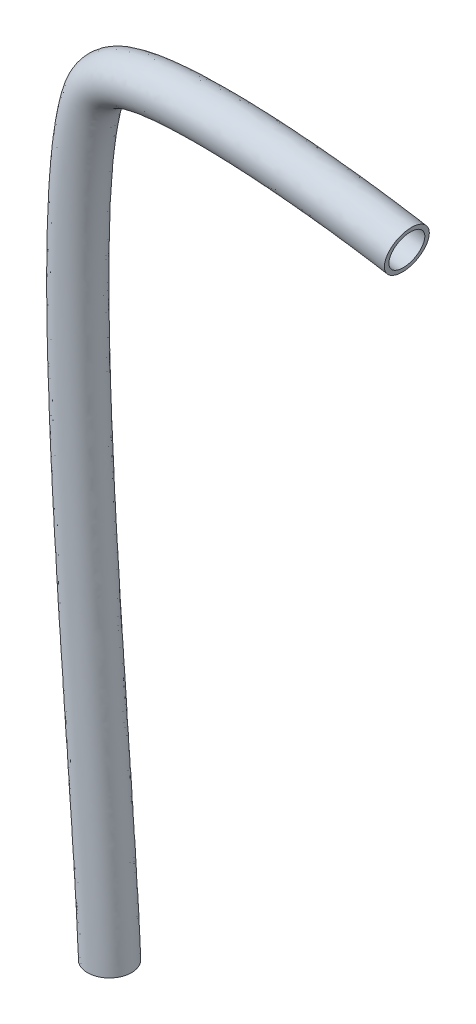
ISO-10303-21;
HEADER;
FILE_DESCRIPTION(('STEP AP214'),'2;1');
FILE_NAME('part.step','',(''),(''),'','','');
FILE_SCHEMA(('AUTOMOTIVE_DESIGN { 1 0 10303 214 1 1 1 1 }'));
ENDSEC;
DATA;
#1=APPLICATION_CONTEXT('core data for automotive mechanical design processes');
#2=APPLICATION_PROTOCOL_DEFINITION('international standard','automotive_design',2000,#1);
#3=PRODUCT_CONTEXT('',#1,'mechanical');
#4=PRODUCT('Part','Part','',(#3));
#5=PRODUCT_RELATED_PRODUCT_CATEGORY('part','',(#4));
#6=PRODUCT_DEFINITION_FORMATION('','',#4);
#7=PRODUCT_DEFINITION_CONTEXT('part definition',#1,'design');
#8=PRODUCT_DEFINITION('design','',#6,#7);
#9=PRODUCT_DEFINITION_SHAPE('','',#8);
#10=(LENGTH_UNIT() NAMED_UNIT(*) SI_UNIT(.MILLI.,.METRE.));
#11=(NAMED_UNIT(*) PLANE_ANGLE_UNIT() SI_UNIT($,.RADIAN.));
#12=(NAMED_UNIT(*) SI_UNIT($,.STERADIAN.) SOLID_ANGLE_UNIT());
#13=UNCERTAINTY_MEASURE_WITH_UNIT(LENGTH_MEASURE(1.E-05),#10,'distance_accuracy_value','');
#14=(GEOMETRIC_REPRESENTATION_CONTEXT(3) GLOBAL_UNCERTAINTY_ASSIGNED_CONTEXT((#13)) GLOBAL_UNIT_ASSIGNED_CONTEXT((#10,
#11,#12)) REPRESENTATION_CONTEXT('',''));
#15=CARTESIAN_POINT('',(0.,0.,0.));
#16=DIRECTION('',(0.,0.,1.));
#17=DIRECTION('',(1.,0.,0.));
#18=AXIS2_PLACEMENT_3D('',#15,#16,#17);
#19=CARTESIAN_POINT('',(0.,0.,5.));
#20=CARTESIAN_POINT('',(-0.169825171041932,4.63118092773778,5.));
#21=CARTESIAN_POINT('',(-0.485152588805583,10.1818612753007,5.));
#22=CARTESIAN_POINT('',(-1.29961480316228,22.6430210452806,5.));
#23=CARTESIAN_POINT('',(-1.79874959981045,29.5535004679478,5.));
#24=CARTESIAN_POINT('',(-3.41106938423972,51.6058376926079,5.));
#25=CARTESIAN_POINT('',(-4.63916976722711,68.0685944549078,5.));
#26=CARTESIAN_POINT('',(-6.54423466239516,100.682907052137,5.));
#27=CARTESIAN_POINT('',(-7.22119917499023,116.834462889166,5.));
#28=CARTESIAN_POINT('',(-7.18011134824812,137.953197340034,5.));
#29=CARTESIAN_POINT('',(-6.99032630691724,144.474675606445,5.));
#30=CARTESIAN_POINT('',(-6.15138091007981,156.002232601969,5.));
#31=CARTESIAN_POINT('',(-5.50222055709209,161.008311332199,5.));
#32=CARTESIAN_POINT('',(-4.29490951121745,166.198789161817,5.));
#33=CARTESIAN_POINT('',(-3.99542919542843,167.29382865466,5.));
#34=CARTESIAN_POINT('',(-3.24426197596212,169.311814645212,5.));
#35=CARTESIAN_POINT('',(-2.79257508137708,170.234761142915,5.));
#36=CARTESIAN_POINT('',(-1.63401981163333,171.909786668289,5.));
#37=CARTESIAN_POINT('',(-0.9271514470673,172.661865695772,5.));
#38=CARTESIAN_POINT('',(0.844741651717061,173.996381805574,5.));
#39=CARTESIAN_POINT('',(1.90976637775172,174.578818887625,5.));
#40=CARTESIAN_POINT('',(4.64036989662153,175.628892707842,5.));
#41=CARTESIAN_POINT('',(6.35824266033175,176.077430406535,5.));
#42=CARTESIAN_POINT('',(10.264142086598,176.786929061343,5.));
#43=CARTESIAN_POINT('',(12.4521687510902,177.047890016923,5.));
#44=CARTESIAN_POINT('',(19.5781316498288,177.577964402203,5.));
#45=CARTESIAN_POINT('',(25.0779507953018,177.594269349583,5.));
#46=CARTESIAN_POINT('',(42.6781563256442,176.860403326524,5.));
#47=CARTESIAN_POINT('',(55.8792908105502,175.32745149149,5.));
#48=CARTESIAN_POINT('',(67.4900000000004,173.36,5.));
#49=CARTESIAN_POINT('',(10.,0.,5.));
#50=CARTESIAN_POINT('',(9.83017482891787,4.79188023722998,5.));
#51=CARTESIAN_POINT('',(9.51220081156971,10.4174084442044,5.));
#52=CARTESIAN_POINT('',(8.69484491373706,22.9796698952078,5.));
#53=CARTESIAN_POINT('',(8.19485211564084,29.911208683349,5.));
#54=CARTESIAN_POINT('',(6.58193139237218,51.9800797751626,5.));
#55=CARTESIAN_POINT('',(5.35612263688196,68.3940440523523,5.));
#56=CARTESIAN_POINT('',(3.45576764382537,100.791265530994,5.));
#57=CARTESIAN_POINT('',(2.78429637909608,116.783748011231,5.));
#58=CARTESIAN_POINT('',(2.80596809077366,137.399712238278,5.));
#59=CARTESIAN_POINT('',(2.98574635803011,143.709580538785,5.));
#60=CARTESIAN_POINT('',(3.7531942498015,154.585621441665,5.));
#61=CARTESIAN_POINT('',(4.36127690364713,159.171921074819,5.));
#62=CARTESIAN_POINT('',(5.29270608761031,163.34658715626,5.));
#63=CARTESIAN_POINT('',(5.48253113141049,164.043899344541,5.));
#64=CARTESIAN_POINT('',(5.75307323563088,164.902536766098,5.));
#65=CARTESIAN_POINT('',(5.81952905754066,165.053836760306,5.));
#66=CARTESIAN_POINT('',(5.77470811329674,165.118537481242,5.));
#67=CARTESIAN_POINT('',(5.65750115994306,165.062192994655,5.));
#68=CARTESIAN_POINT('',(5.69883921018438,165.190110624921,5.));
#69=CARTESIAN_POINT('',(5.88764600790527,165.371376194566,5.));
#70=CARTESIAN_POINT('',(7.07335806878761,165.89147518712,5.));
#71=CARTESIAN_POINT('',(8.23015993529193,166.243846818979,5.));
#72=CARTESIAN_POINT('',(11.2431840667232,166.824754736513,5.));
#73=CARTESIAN_POINT('',(13.1019470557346,167.065259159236,5.));
#74=CARTESIAN_POINT('',(19.4061916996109,167.564425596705,5.));
#75=CARTESIAN_POINT('',(24.5732737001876,167.603126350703,5.));
#76=CARTESIAN_POINT('',(41.3401374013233,166.934666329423,5.));
#77=CARTESIAN_POINT('',(54.2331647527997,165.456044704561,5.));
#78=CARTESIAN_POINT('',(65.4591212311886,163.568394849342,5.));
#79=CARTESIAN_POINT('',(10.,0.,-5.));
#80=CARTESIAN_POINT('',(9.83017482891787,4.79188023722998,-5.));
#81=CARTESIAN_POINT('',(9.51220081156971,10.4174084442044,-5.));
#82=CARTESIAN_POINT('',(8.69484491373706,22.9796698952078,-5.));
#83=CARTESIAN_POINT('',(8.19485211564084,29.911208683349,-5.));
#84=CARTESIAN_POINT('',(6.58193139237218,51.9800797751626,-5.));
#85=CARTESIAN_POINT('',(5.35612263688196,68.3940440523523,-5.));
#86=CARTESIAN_POINT('',(3.45576764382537,100.791265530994,-5.));
#87=CARTESIAN_POINT('',(2.78429637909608,116.783748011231,-5.));
#88=CARTESIAN_POINT('',(2.80596809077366,137.399712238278,-5.));
#89=CARTESIAN_POINT('',(2.98574635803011,143.709580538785,-5.));
#90=CARTESIAN_POINT('',(3.7531942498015,154.585621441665,-5.));
#91=CARTESIAN_POINT('',(4.36127690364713,159.171921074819,-5.));
#92=CARTESIAN_POINT('',(5.2927060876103,163.34658715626,-5.));
#93=CARTESIAN_POINT('',(5.48253113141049,164.043899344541,-5.));
#94=CARTESIAN_POINT('',(5.75307323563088,164.902536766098,-5.));
#95=CARTESIAN_POINT('',(5.81952905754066,165.053836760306,-5.));
#96=CARTESIAN_POINT('',(5.77470811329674,165.118537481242,-5.));
#97=CARTESIAN_POINT('',(5.65750115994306,165.062192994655,-5.));
#98=CARTESIAN_POINT('',(5.69883921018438,165.190110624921,-5.));
#99=CARTESIAN_POINT('',(5.88764600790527,165.371376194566,-5.));
#100=CARTESIAN_POINT('',(7.07335806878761,165.89147518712,-5.));
#101=CARTESIAN_POINT('',(8.23015993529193,166.243846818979,-5.));
#102=CARTESIAN_POINT('',(11.2431840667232,166.824754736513,-5.));
#103=CARTESIAN_POINT('',(13.1019470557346,167.065259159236,-5.));
#104=CARTESIAN_POINT('',(19.4061916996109,167.564425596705,-5.));
#105=CARTESIAN_POINT('',(24.5732737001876,167.603126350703,-5.));
#106=CARTESIAN_POINT('',(41.3401374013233,166.934666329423,-5.));
#107=CARTESIAN_POINT('',(54.2331647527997,165.456044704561,-5.));
#108=CARTESIAN_POINT('',(65.4591212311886,163.568394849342,-5.));
#109=CARTESIAN_POINT('',(0.,0.,-5.));
#110=CARTESIAN_POINT('',(-0.169825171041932,4.63118092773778,-5.));
#111=CARTESIAN_POINT('',(-0.485152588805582,10.1818612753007,-5.));
#112=CARTESIAN_POINT('',(-1.29961480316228,22.6430210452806,-5.));
#113=CARTESIAN_POINT('',(-1.79874959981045,29.5535004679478,-5.));
#114=CARTESIAN_POINT('',(-3.41106938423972,51.6058376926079,-5.));
#115=CARTESIAN_POINT('',(-4.63916976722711,68.0685944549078,-5.));
#116=CARTESIAN_POINT('',(-6.54423466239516,100.682907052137,-5.));
#117=CARTESIAN_POINT('',(-7.22119917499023,116.834462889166,-5.));
#118=CARTESIAN_POINT('',(-7.18011134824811,137.953197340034,-5.));
#119=CARTESIAN_POINT('',(-6.99032630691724,144.474675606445,-5.));
#120=CARTESIAN_POINT('',(-6.15138091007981,156.002232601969,-5.));
#121=CARTESIAN_POINT('',(-5.50222055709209,161.008311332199,-5.));
#122=CARTESIAN_POINT('',(-4.29490951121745,166.198789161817,-5.));
#123=CARTESIAN_POINT('',(-3.99542919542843,167.29382865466,-5.));
#124=CARTESIAN_POINT('',(-3.24426197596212,169.311814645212,-5.));
#125=CARTESIAN_POINT('',(-2.79257508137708,170.234761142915,-5.));
#126=CARTESIAN_POINT('',(-1.63401981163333,171.909786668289,-5.));
#127=CARTESIAN_POINT('',(-0.9271514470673,172.661865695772,-5.));
#128=CARTESIAN_POINT('',(0.844741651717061,173.996381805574,-5.));
#129=CARTESIAN_POINT('',(1.90976637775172,174.578818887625,-5.));
#130=CARTESIAN_POINT('',(4.64036989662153,175.628892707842,-5.));
#131=CARTESIAN_POINT('',(6.35824266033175,176.077430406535,-5.));
#132=CARTESIAN_POINT('',(10.264142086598,176.786929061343,-5.));
#133=CARTESIAN_POINT('',(12.4521687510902,177.047890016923,-5.));
#134=CARTESIAN_POINT('',(19.5781316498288,177.577964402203,-5.));
#135=CARTESIAN_POINT('',(25.0779507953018,177.594269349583,-5.));
#136=CARTESIAN_POINT('',(42.6781563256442,176.860403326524,-5.));
#137=CARTESIAN_POINT('',(55.8792908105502,175.32745149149,-5.));
#138=CARTESIAN_POINT('',(67.4900000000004,173.36,-5.));
#139=CARTESIAN_POINT('',(-10.,0.,-5.));
#140=CARTESIAN_POINT('',(-10.1698251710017,4.47048161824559,-5.));
#141=CARTESIAN_POINT('',(-10.4825059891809,9.94631410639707,-5.));
#142=CARTESIAN_POINT('',(-11.2940745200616,22.3063721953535,-5.));
#143=CARTESIAN_POINT('',(-11.7923513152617,29.1957922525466,-5.));
#144=CARTESIAN_POINT('',(-13.4040701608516,51.2315956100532,-5.));
#145=CARTESIAN_POINT('',(-14.6344621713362,67.7431448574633,-5.));
#146=CARTESIAN_POINT('',(-16.5442369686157,100.574548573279,-5.));
#147=CARTESIAN_POINT('',(-17.2266947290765,116.885177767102,-5.));
#148=CARTESIAN_POINT('',(-17.1661907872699,138.506682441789,-5.));
#149=CARTESIAN_POINT('',(-16.9663989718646,145.239770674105,-5.));
#150=CARTESIAN_POINT('',(-16.0559560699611,157.418843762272,-5.));
#151=CARTESIAN_POINT('',(-15.3657180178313,162.844701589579,-5.));
#152=CARTESIAN_POINT('',(-13.8825251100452,169.050991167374,-5.));
#153=CARTESIAN_POINT('',(-13.4733895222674,170.543757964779,-5.));
#154=CARTESIAN_POINT('',(-12.2415971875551,173.721092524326,-5.));
#155=CARTESIAN_POINT('',(-11.4046792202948,175.415685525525,-5.));
#156=CARTESIAN_POINT('',(-9.0427477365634,178.701035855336,-5.));
#157=CARTESIAN_POINT('',(-7.51180405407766,180.261538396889,-5.));
#158=CARTESIAN_POINT('',(-4.00935590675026,182.802652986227,-5.));
#159=CARTESIAN_POINT('',(-2.06811325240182,183.786261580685,-5.));
#160=CARTESIAN_POINT('',(2.20738172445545,185.366310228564,-5.));
#161=CARTESIAN_POINT('',(4.48632538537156,185.911013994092,-5.));
#162=CARTESIAN_POINT('',(9.2851001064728,186.749103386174,-5.));
#163=CARTESIAN_POINT('',(11.8023904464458,187.030520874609,-5.));
#164=CARTESIAN_POINT('',(19.7500716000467,187.591503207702,-5.));
#165=CARTESIAN_POINT('',(25.5826278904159,187.585412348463,-5.));
#166=CARTESIAN_POINT('',(44.0161752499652,186.786140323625,-5.));
#167=CARTESIAN_POINT('',(57.5254168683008,185.198858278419,-5.));
#168=CARTESIAN_POINT('',(69.5208787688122,183.151605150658,-5.));
#169=CARTESIAN_POINT('',(-10.,0.,5.));
#170=CARTESIAN_POINT('',(-10.1698251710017,4.47048161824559,5.));
#171=CARTESIAN_POINT('',(-10.4825059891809,9.94631410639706,5.));
#172=CARTESIAN_POINT('',(-11.2940745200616,22.3063721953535,5.));
#173=CARTESIAN_POINT('',(-11.7923513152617,29.1957922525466,5.));
#174=CARTESIAN_POINT('',(-13.4040701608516,51.2315956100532,5.));
#175=CARTESIAN_POINT('',(-14.6344621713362,67.7431448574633,5.));
#176=CARTESIAN_POINT('',(-16.5442369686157,100.574548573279,5.));
#177=CARTESIAN_POINT('',(-17.2266947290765,116.885177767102,5.));
#178=CARTESIAN_POINT('',(-17.1661907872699,138.506682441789,5.));
#179=CARTESIAN_POINT('',(-16.9663989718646,145.239770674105,5.));
#180=CARTESIAN_POINT('',(-16.0559560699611,157.418843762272,5.));
#181=CARTESIAN_POINT('',(-15.3657180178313,162.844701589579,5.));
#182=CARTESIAN_POINT('',(-13.8825251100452,169.050991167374,5.));
#183=CARTESIAN_POINT('',(-13.4733895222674,170.543757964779,5.));
#184=CARTESIAN_POINT('',(-12.2415971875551,173.721092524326,5.));
#185=CARTESIAN_POINT('',(-11.4046792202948,175.415685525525,5.));
#186=CARTESIAN_POINT('',(-9.0427477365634,178.701035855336,5.));
#187=CARTESIAN_POINT('',(-7.51180405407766,180.261538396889,5.));
#188=CARTESIAN_POINT('',(-4.00935590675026,182.802652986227,5.));
#189=CARTESIAN_POINT('',(-2.06811325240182,183.786261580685,5.));
#190=CARTESIAN_POINT('',(2.20738172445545,185.366310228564,5.));
#191=CARTESIAN_POINT('',(4.48632538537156,185.911013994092,5.));
#192=CARTESIAN_POINT('',(9.2851001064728,186.749103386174,5.));
#193=CARTESIAN_POINT('',(11.8023904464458,187.030520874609,5.));
#194=CARTESIAN_POINT('',(19.7500716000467,187.591503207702,5.));
#195=CARTESIAN_POINT('',(25.5826278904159,187.585412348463,5.));
#196=CARTESIAN_POINT('',(44.0161752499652,186.786140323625,5.));
#197=CARTESIAN_POINT('',(57.5254168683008,185.198858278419,5.));
#198=CARTESIAN_POINT('',(69.5208787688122,183.151605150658,5.));
#199=CARTESIAN_POINT('',(0.,0.,5.));
#200=CARTESIAN_POINT('',(-0.169825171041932,4.63118092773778,5.));
#201=CARTESIAN_POINT('',(-0.485152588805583,10.1818612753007,5.));
#202=CARTESIAN_POINT('',(-1.29961480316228,22.6430210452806,5.));
#203=CARTESIAN_POINT('',(-1.79874959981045,29.5535004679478,5.));
#204=CARTESIAN_POINT('',(-3.41106938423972,51.6058376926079,5.));
#205=CARTESIAN_POINT('',(-4.63916976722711,68.0685944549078,5.));
#206=CARTESIAN_POINT('',(-6.54423466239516,100.682907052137,5.));
#207=CARTESIAN_POINT('',(-7.22119917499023,116.834462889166,5.));
#208=CARTESIAN_POINT('',(-7.18011134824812,137.953197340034,5.));
#209=CARTESIAN_POINT('',(-6.99032630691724,144.474675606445,5.));
#210=CARTESIAN_POINT('',(-6.15138091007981,156.002232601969,5.));
#211=CARTESIAN_POINT('',(-5.50222055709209,161.008311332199,5.));
#212=CARTESIAN_POINT('',(-4.29490951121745,166.198789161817,5.));
#213=CARTESIAN_POINT('',(-3.99542919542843,167.29382865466,5.));
#214=CARTESIAN_POINT('',(-3.24426197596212,169.311814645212,5.));
#215=CARTESIAN_POINT('',(-2.79257508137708,170.234761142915,5.));
#216=CARTESIAN_POINT('',(-1.63401981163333,171.909786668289,5.));
#217=CARTESIAN_POINT('',(-0.9271514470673,172.661865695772,5.));
#218=CARTESIAN_POINT('',(0.844741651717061,173.996381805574,5.));
#219=CARTESIAN_POINT('',(1.90976637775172,174.578818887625,5.));
#220=CARTESIAN_POINT('',(4.64036989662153,175.628892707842,5.));
#221=CARTESIAN_POINT('',(6.35824266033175,176.077430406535,5.));
#222=CARTESIAN_POINT('',(10.264142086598,176.786929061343,5.));
#223=CARTESIAN_POINT('',(12.4521687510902,177.047890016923,5.));
#224=CARTESIAN_POINT('',(19.5781316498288,177.577964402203,5.));
#225=CARTESIAN_POINT('',(25.0779507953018,177.594269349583,5.));
#226=CARTESIAN_POINT('',(42.6781563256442,176.860403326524,5.));
#227=CARTESIAN_POINT('',(55.8792908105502,175.32745149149,5.));
#228=CARTESIAN_POINT('',(67.4900000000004,173.36,5.));
#229=(BOUNDED_SURFACE() B_SPLINE_SURFACE(3,3,((#19,#20,#21,#22,#23,#24,#25,#26,#27,#28,#29,#30,
#31,#32,#33,#34,#35,#36,#37,#38,#39,#40,#41,#42,#43,#44,#45,#46,#47,#48),(#49,#50,#51,#52,#53,
#54,#55,#56,#57,#58,#59,#60,#61,#62,#63,#64,#65,#66,#67,#68,#69,#70,#71,#72,#73,#74,#75,#76,#77,
#78),(#79,#80,#81,#82,#83,#84,#85,#86,#87,#88,#89,#90,#91,#92,#93,#94,#95,#96,#97,#98,#99,#100,
#101,#102,#103,#104,#105,#106,#107,#108),(#109,#110,#111,#112,#113,#114,#115,#116,#117,#118,
#119,#120,#121,#122,#123,#124,#125,#126,#127,#128,#129,#130,#131,#132,#133,#134,#135,#136,#137,
#138),(#139,#140,#141,#142,#143,#144,#145,#146,#147,#148,#149,#150,#151,#152,#153,#154,#155,
#156,#157,#158,#159,#160,#161,#162,#163,#164,#165,#166,#167,#168),(#169,#170,#171,#172,#173,
#174,#175,#176,#177,#178,#179,#180,#181,#182,#183,#184,#185,#186,#187,#188,#189,#190,#191,#192,
#193,#194,#195,#196,#197,#198),(#199,#200,#201,#202,#203,#204,#205,#206,#207,#208,#209,#210,
#211,#212,#213,#214,#215,#216,#217,#218,#219,#220,#221,#222,#223,#224,#225,#226,#227,#228)),
.UNSPECIFIED.,.T.,.F.,.F.) B_SPLINE_SURFACE_WITH_KNOTS((4,3,4),(4,2,2,2,2,2,2,2,2,2,2,2,2,2,4),
(0.,0.5,1.),(0.,0.0848096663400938,0.169619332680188,0.339238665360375,0.508857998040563,
0.593667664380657,0.678477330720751,0.703477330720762,0.728477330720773,0.753477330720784,
0.778477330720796,0.806167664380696,0.833857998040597,0.889238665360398,1.),
.UNSPECIFIED.) GEOMETRIC_REPRESENTATION_ITEM() RATIONAL_B_SPLINE_SURFACE(((1.,1.,1.,1.,1.,1.,1.,
1.,1.,1.,1.,1.,1.,1.,1.,1.,1.,1.,1.,1.,1.,1.,1.,1.,1.,1.,1.,1.,1.,1.),(0.333333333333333,
0.333333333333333,0.333333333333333,0.333333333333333,0.333333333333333,0.333333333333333,
0.333333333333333,0.333333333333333,0.333333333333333,0.333333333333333,0.333333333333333,
0.333333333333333,0.333333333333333,0.333333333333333,0.333333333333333,0.333333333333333,
0.333333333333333,0.333333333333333,0.333333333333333,0.333333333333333,0.333333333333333,
0.333333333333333,0.333333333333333,0.333333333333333,0.333333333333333,0.333333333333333,
0.333333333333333,0.333333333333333,0.333333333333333,0.333333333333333),(0.333333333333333,
0.333333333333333,0.333333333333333,0.333333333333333,0.333333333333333,0.333333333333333,
0.333333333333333,0.333333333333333,0.333333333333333,0.333333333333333,0.333333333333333,
0.333333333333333,0.333333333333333,0.333333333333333,0.333333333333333,0.333333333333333,
0.333333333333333,0.333333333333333,0.333333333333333,0.333333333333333,0.333333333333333,
0.333333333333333,0.333333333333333,0.333333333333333,0.333333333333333,0.333333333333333,
0.333333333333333,0.333333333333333,0.333333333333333,0.333333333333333),(1.,1.,1.,1.,1.,1.,1.,
1.,1.,1.,1.,1.,1.,1.,1.,1.,1.,1.,1.,1.,1.,1.,1.,1.,1.,1.,1.,1.,1.,1.),(0.333333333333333,
0.333333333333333,0.333333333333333,0.333333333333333,0.333333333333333,0.333333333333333,
0.333333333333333,0.333333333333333,0.333333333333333,0.333333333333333,0.333333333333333,
0.333333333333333,0.333333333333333,0.333333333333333,0.333333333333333,0.333333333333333,
0.333333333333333,0.333333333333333,0.333333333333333,0.333333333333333,0.333333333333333,
0.333333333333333,0.333333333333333,0.333333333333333,0.333333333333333,0.333333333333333,
0.333333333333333,0.333333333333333,0.333333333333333,0.333333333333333),(0.333333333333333,
0.333333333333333,0.333333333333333,0.333333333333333,0.333333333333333,0.333333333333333,
0.333333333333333,0.333333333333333,0.333333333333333,0.333333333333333,0.333333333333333,
0.333333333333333,0.333333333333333,0.333333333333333,0.333333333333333,0.333333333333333,
0.333333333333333,0.333333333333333,0.333333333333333,0.333333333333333,0.333333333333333,
0.333333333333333,0.333333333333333,0.333333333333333,0.333333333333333,0.333333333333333,
0.333333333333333,0.333333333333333,0.333333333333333,0.333333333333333),(1.,1.,1.,1.,1.,1.,1.,
1.,1.,1.,1.,1.,1.,1.,1.,1.,1.,1.,1.,1.,1.,1.,1.,1.,1.,1.,1.,1.,1.,1.))) REPRESENTATION_ITEM('') SURFACE());
#230=CARTESIAN_POINT('',(67.4900000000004,173.36,0.));
#231=DIRECTION('',(0.979160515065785,-0.203087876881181,0.));
#232=DIRECTION('',(0.,0.,1.));
#233=AXIS2_PLACEMENT_3D('',#230,#231,#232);
#234=CIRCLE('',#233,5.);
#235=CARTESIAN_POINT('',(67.4900000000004,173.36,5.));
#236=VERTEX_POINT('',#235);
#237=EDGE_CURVE('E60',#236,#236,#234,.T.);
#238=CARTESIAN_POINT('',(0.,0.,0.));
#239=DIRECTION('',(0.,1.,0.));
#240=DIRECTION('',(0.,0.,1.));
#241=AXIS2_PLACEMENT_3D('',#238,#239,#240);
#242=CIRCLE('',#241,5.);
#243=CARTESIAN_POINT('',(0.,0.,5.));
#244=VERTEX_POINT('',#243);
#245=EDGE_CURVE('E44',#244,#244,#242,.T.);
#246=ORIENTED_EDGE('',*,*,#237,.F.);
#247=EDGE_LOOP('',(#246));
#248=FACE_BOUND('',#247,.T.);
#249=ORIENTED_EDGE('',*,*,#245,.T.);
#250=EDGE_LOOP('',(#249));
#251=FACE_BOUND('',#250,.T.);
#252=ADVANCED_FACE('F39',(#248,#251),#229,.T.);
#253=CARTESIAN_POINT('',(0.,0.,0.));
#254=DIRECTION('',(0.,1.,0.));
#255=DIRECTION('',(0.,0.,1.));
#256=AXIS2_PLACEMENT_3D('',#253,#254,#255);
#257=PLANE('',#256);
#258=CARTESIAN_POINT('',(0.,0.,0.));
#259=DIRECTION('',(0.,1.,0.));
#260=DIRECTION('',(0.,0.,1.));
#261=AXIS2_PLACEMENT_3D('',#258,#259,#260);
#262=CIRCLE('',#261,4.);
#263=CARTESIAN_POINT('',(0.,0.,4.));
#264=VERTEX_POINT('',#263);
#265=EDGE_CURVE('E50',#264,#264,#262,.F.);
#266=ORIENTED_EDGE('',*,*,#265,.F.);
#267=EDGE_LOOP('',(#266));
#268=FACE_BOUND('',#267,.T.);
#269=ORIENTED_EDGE('',*,*,#245,.F.);
#270=EDGE_LOOP('',(#269));
#271=FACE_BOUND('',#270,.T.);
#272=ADVANCED_FACE('F81',(#268,#271),#257,.F.);
#273=CARTESIAN_POINT('',(67.4900000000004,173.36,0.));
#274=DIRECTION('',(0.979160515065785,-0.203087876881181,0.));
#275=DIRECTION('',(0.,0.,1.));
#276=AXIS2_PLACEMENT_3D('',#273,#274,#275);
#277=PLANE('',#276);
#278=CARTESIAN_POINT('',(67.4900000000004,173.36,0.));
#279=DIRECTION('',(0.979160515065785,-0.203087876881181,0.));
#280=DIRECTION('',(0.,0.,1.));
#281=AXIS2_PLACEMENT_3D('',#278,#279,#280);
#282=CIRCLE('',#281,4.);
#283=CARTESIAN_POINT('',(67.4900000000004,173.36,4.));
#284=VERTEX_POINT('',#283);
#285=EDGE_CURVE('E11',#284,#284,#282,.F.);
#286=ORIENTED_EDGE('',*,*,#285,.T.);
#287=EDGE_LOOP('',(#286));
#288=FACE_BOUND('',#287,.T.);
#289=ORIENTED_EDGE('',*,*,#237,.T.);
#290=EDGE_LOOP('',(#289));
#291=FACE_BOUND('',#290,.T.);
#292=ADVANCED_FACE('F67',(#288,#291),#277,.T.);
#293=CARTESIAN_POINT('',(0.,0.,4.));
#294=CARTESIAN_POINT('',(-0.339650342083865,9.26236185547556,4.));
#295=CARTESIAN_POINT('',(-1.26130967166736,22.2027213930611,4.));
#296=CARTESIAN_POINT('',(-3.41106938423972,51.6058376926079,4.));
#297=CARTESIAN_POINT('',(-4.63916976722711,68.0685944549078,4.));
#298=CARTESIAN_POINT('',(-6.54423466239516,100.682907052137,4.));
#299=CARTESIAN_POINT('',(-7.22119917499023,116.834462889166,4.));
#300=CARTESIAN_POINT('',(-7.18011134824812,137.953197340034,4.));
#301=CARTESIAN_POINT('',(-6.99032630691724,144.474675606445,4.));
#302=CARTESIAN_POINT('',(-6.15138091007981,156.002232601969,4.));
#303=CARTESIAN_POINT('',(-5.50222055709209,161.008311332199,4.));
#304=CARTESIAN_POINT('',(-4.29490951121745,166.198789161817,4.));
#305=CARTESIAN_POINT('',(-3.99542919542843,167.29382865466,4.));
#306=CARTESIAN_POINT('',(-3.24426197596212,169.311814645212,4.));
#307=CARTESIAN_POINT('',(-2.79257508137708,170.234761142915,4.));
#308=CARTESIAN_POINT('',(-1.63401981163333,171.909786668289,4.));
#309=CARTESIAN_POINT('',(-0.9271514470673,172.661865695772,4.));
#310=CARTESIAN_POINT('',(0.844741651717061,173.996381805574,4.));
#311=CARTESIAN_POINT('',(1.90976637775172,174.578818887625,4.));
#312=CARTESIAN_POINT('',(4.64036989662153,175.628892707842,4.));
#313=CARTESIAN_POINT('',(6.35824266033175,176.077430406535,4.));
#314=CARTESIAN_POINT('',(10.264142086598,176.786929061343,4.));
#315=CARTESIAN_POINT('',(12.4521687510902,177.047890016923,4.));
#316=CARTESIAN_POINT('',(19.5781316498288,177.577964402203,4.));
#317=CARTESIAN_POINT('',(25.0779507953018,177.594269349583,4.));
#318=CARTESIAN_POINT('',(42.6781563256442,176.860403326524,4.));
#319=CARTESIAN_POINT('',(55.8792908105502,175.32745149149,4.));
#320=CARTESIAN_POINT('',(67.4900000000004,173.36,4.));
#321=CARTESIAN_POINT('',(-8.,0.,4.));
#322=CARTESIAN_POINT('',(-8.33965034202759,9.00524296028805,4.));
#323=CARTESIAN_POINT('',(-9.25635129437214,21.92096385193,4.));
#324=CARTESIAN_POINT('',(-11.4054700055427,51.3064440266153,4.));
#325=CARTESIAN_POINT('',(-12.6354036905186,67.8082347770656,4.));
#326=CARTESIAN_POINT('',(-14.5442365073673,100.596220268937,4.));
#327=CARTESIAN_POINT('',(-15.2255956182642,116.875034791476,4.));
#328=CARTESIAN_POINT('',(-15.1689748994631,138.395985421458,4.));
#329=CARTESIAN_POINT('',(-14.9711844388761,145.086751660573,4.));
#330=CARTESIAN_POINT('',(-14.0750410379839,157.135521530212,4.));
#331=CARTESIAN_POINT('',(-13.3930185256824,162.477423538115,4.));
#332=CARTESIAN_POINT('',(-11.96500199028,168.480550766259,4.));
#333=CARTESIAN_POINT('',(-11.5777974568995,169.893772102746,4.));
#334=CARTESIAN_POINT('',(-10.4421301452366,172.839236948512,4.));
#335=CARTESIAN_POINT('',(-9.68225839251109,174.379500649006,4.));
#336=CARTESIAN_POINT('',(-7.56100215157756,177.342786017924,4.));
#337=CARTESIAN_POINT('',(-6.19487353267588,178.741603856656,4.));
#338=CARTESIAN_POINT('',(-3.0385363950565,181.041398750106,4.));
#339=CARTESIAN_POINT('',(-1.27253732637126,181.944773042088,4.));
#340=CARTESIAN_POINT('',(2.69397935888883,183.418826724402,4.));
#341=CARTESIAN_POINT('',(4.86070884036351,183.944297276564,4.));
#342=CARTESIAN_POINT('',(9.48090850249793,184.756668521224,4.));
#343=CARTESIAN_POINT('',(11.9323461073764,185.033994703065,4.));
#344=CARTESIAN_POINT('',(19.7156836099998,185.588795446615,4.));
#345=CARTESIAN_POINT('',(25.4816924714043,185.587183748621,4.));
#346=CARTESIAN_POINT('',(43.7485714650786,184.800992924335,4.));
#347=CARTESIAN_POINT('',(57.1961916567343,183.224576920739,4.));
#348=CARTESIAN_POINT('',(69.1147030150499,181.193284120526,4.));
#349=CARTESIAN_POINT('',(-8.,0.,-4.));
#350=CARTESIAN_POINT('',(-8.33965034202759,9.00524296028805,-4.));
#351=CARTESIAN_POINT('',(-9.25635129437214,21.92096385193,-4.));
#352=CARTESIAN_POINT('',(-11.4054700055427,51.3064440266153,-4.));
#353=CARTESIAN_POINT('',(-12.6354036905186,67.8082347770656,-4.));
#354=CARTESIAN_POINT('',(-14.5442365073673,100.596220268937,-4.));
#355=CARTESIAN_POINT('',(-15.2255956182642,116.875034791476,-4.));
#356=CARTESIAN_POINT('',(-15.1689748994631,138.395985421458,-4.));
#357=CARTESIAN_POINT('',(-14.9711844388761,145.086751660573,-4.));
#358=CARTESIAN_POINT('',(-14.0750410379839,157.135521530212,-4.));
#359=CARTESIAN_POINT('',(-13.3930185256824,162.477423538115,-4.));
#360=CARTESIAN_POINT('',(-11.96500199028,168.480550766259,-4.));
#361=CARTESIAN_POINT('',(-11.5777974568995,169.893772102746,-4.));
#362=CARTESIAN_POINT('',(-10.4421301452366,172.839236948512,-4.));
#363=CARTESIAN_POINT('',(-9.68225839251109,174.379500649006,-4.));
#364=CARTESIAN_POINT('',(-7.56100215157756,177.342786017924,-4.));
#365=CARTESIAN_POINT('',(-6.19487353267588,178.741603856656,-4.));
#366=CARTESIAN_POINT('',(-3.0385363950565,181.041398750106,-4.));
#367=CARTESIAN_POINT('',(-1.27253732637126,181.944773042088,-4.));
#368=CARTESIAN_POINT('',(2.69397935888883,183.418826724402,-4.));
#369=CARTESIAN_POINT('',(4.86070884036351,183.944297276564,-4.));
#370=CARTESIAN_POINT('',(9.48090850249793,184.756668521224,-4.));
#371=CARTESIAN_POINT('',(11.9323461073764,185.033994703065,-4.));
#372=CARTESIAN_POINT('',(19.7156836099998,185.588795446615,-4.));
#373=CARTESIAN_POINT('',(25.4816924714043,185.587183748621,-4.));
#374=CARTESIAN_POINT('',(43.7485714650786,184.800992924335,-4.));
#375=CARTESIAN_POINT('',(57.1961916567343,183.224576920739,-4.));
#376=CARTESIAN_POINT('',(69.1147030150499,181.193284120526,-4.));
#377=CARTESIAN_POINT('',(0.,0.,-4.));
#378=CARTESIAN_POINT('',(-0.339650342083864,9.26236185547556,-4.));
#379=CARTESIAN_POINT('',(-1.26130967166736,22.2027213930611,-4.));
#380=CARTESIAN_POINT('',(-3.41106938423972,51.6058376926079,-4.));
#381=CARTESIAN_POINT('',(-4.63916976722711,68.0685944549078,-4.));
#382=CARTESIAN_POINT('',(-6.54423466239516,100.682907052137,-4.));
#383=CARTESIAN_POINT('',(-7.22119917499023,116.834462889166,-4.));
#384=CARTESIAN_POINT('',(-7.18011134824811,137.953197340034,-4.));
#385=CARTESIAN_POINT('',(-6.99032630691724,144.474675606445,-4.));
#386=CARTESIAN_POINT('',(-6.15138091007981,156.002232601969,-4.));
#387=CARTESIAN_POINT('',(-5.50222055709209,161.008311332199,-4.));
#388=CARTESIAN_POINT('',(-4.29490951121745,166.198789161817,-4.));
#389=CARTESIAN_POINT('',(-3.99542919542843,167.29382865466,-4.));
#390=CARTESIAN_POINT('',(-3.24426197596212,169.311814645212,-4.));
#391=CARTESIAN_POINT('',(-2.79257508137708,170.234761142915,-4.));
#392=CARTESIAN_POINT('',(-1.63401981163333,171.909786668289,-4.));
#393=CARTESIAN_POINT('',(-0.9271514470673,172.661865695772,-4.));
#394=CARTESIAN_POINT('',(0.844741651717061,173.996381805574,-4.));
#395=CARTESIAN_POINT('',(1.90976637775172,174.578818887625,-4.));
#396=CARTESIAN_POINT('',(4.64036989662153,175.628892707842,-4.));
#397=CARTESIAN_POINT('',(6.35824266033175,176.077430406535,-4.));
#398=CARTESIAN_POINT('',(10.264142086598,176.786929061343,-4.));
#399=CARTESIAN_POINT('',(12.4521687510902,177.047890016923,-4.));
#400=CARTESIAN_POINT('',(19.5781316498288,177.577964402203,-4.));
#401=CARTESIAN_POINT('',(25.0779507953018,177.594269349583,-4.));
#402=CARTESIAN_POINT('',(42.6781563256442,176.860403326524,-4.));
#403=CARTESIAN_POINT('',(55.8792908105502,175.32745149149,-4.));
#404=CARTESIAN_POINT('',(67.4900000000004,173.36,-4.));
#405=CARTESIAN_POINT('',(8.,0.,-4.));
#406=CARTESIAN_POINT('',(7.66034965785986,9.51948075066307,-4.));
#407=CARTESIAN_POINT('',(6.73373195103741,22.4844789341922,-4.));
#408=CARTESIAN_POINT('',(4.58333123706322,51.9052313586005,-4.));
#409=CARTESIAN_POINT('',(3.3570641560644,68.32895413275,-4.));
#410=CARTESIAN_POINT('',(1.45576718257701,100.769593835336,-4.));
#411=CARTESIAN_POINT('',(0.783197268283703,116.793890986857,-4.));
#412=CARTESIAN_POINT('',(0.808752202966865,137.51040925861,-4.));
#413=CARTESIAN_POINT('',(0.990531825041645,143.862599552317,-4.));
#414=CARTESIAN_POINT('',(1.77227921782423,154.868943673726,-4.));
#415=CARTESIAN_POINT('',(2.38857741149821,159.539199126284,-4.));
#416=CARTESIAN_POINT('',(3.37518296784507,163.917027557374,-4.));
#417=CARTESIAN_POINT('',(3.58693906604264,164.693885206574,-4.));
#418=CARTESIAN_POINT('',(3.95360619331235,165.784392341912,-4.));
#419=CARTESIAN_POINT('',(4.09710822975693,166.090021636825,-4.));
#420=CARTESIAN_POINT('',(4.2929625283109,166.476787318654,-4.));
#421=CARTESIAN_POINT('',(4.34057063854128,166.582127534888,-4.));
#422=CARTESIAN_POINT('',(4.72801969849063,166.951364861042,-4.));
#423=CARTESIAN_POINT('',(5.09207008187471,167.212864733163,-4.));
#424=CARTESIAN_POINT('',(6.58676043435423,167.838958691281,-4.));
#425=CARTESIAN_POINT('',(7.85577648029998,168.210563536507,-4.));
#426=CARTESIAN_POINT('',(11.0473756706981,168.817189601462,-4.));
#427=CARTESIAN_POINT('',(12.9719913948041,169.06178533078,-4.));
#428=CARTESIAN_POINT('',(19.4405796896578,169.567133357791,-4.));
#429=CARTESIAN_POINT('',(24.6742091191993,169.601354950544,-4.));
#430=CARTESIAN_POINT('',(41.6077411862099,168.919813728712,-4.));
#431=CARTESIAN_POINT('',(54.5623899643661,167.430326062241,-4.));
#432=CARTESIAN_POINT('',(65.865296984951,165.526715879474,-4.));
#433=CARTESIAN_POINT('',(8.,0.,4.));
#434=CARTESIAN_POINT('',(7.66034965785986,9.51948075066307,4.));
#435=CARTESIAN_POINT('',(6.73373195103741,22.4844789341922,4.));
#436=CARTESIAN_POINT('',(4.58333123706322,51.9052313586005,4.));
#437=CARTESIAN_POINT('',(3.3570641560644,68.3289541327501,4.));
#438=CARTESIAN_POINT('',(1.45576718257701,100.769593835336,4.));
#439=CARTESIAN_POINT('',(0.783197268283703,116.793890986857,4.));
#440=CARTESIAN_POINT('',(0.808752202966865,137.51040925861,4.));
#441=CARTESIAN_POINT('',(0.990531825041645,143.862599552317,4.));
#442=CARTESIAN_POINT('',(1.77227921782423,154.868943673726,4.));
#443=CARTESIAN_POINT('',(2.38857741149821,159.539199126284,4.));
#444=CARTESIAN_POINT('',(3.37518296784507,163.917027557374,4.));
#445=CARTESIAN_POINT('',(3.58693906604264,164.693885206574,4.));
#446=CARTESIAN_POINT('',(3.95360619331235,165.784392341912,4.));
#447=CARTESIAN_POINT('',(4.09710822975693,166.090021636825,4.));
#448=CARTESIAN_POINT('',(4.2929625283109,166.476787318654,4.));
#449=CARTESIAN_POINT('',(4.34057063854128,166.582127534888,4.));
#450=CARTESIAN_POINT('',(4.72801969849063,166.951364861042,4.));
#451=CARTESIAN_POINT('',(5.09207008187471,167.212864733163,4.));
#452=CARTESIAN_POINT('',(6.58676043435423,167.838958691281,4.));
#453=CARTESIAN_POINT('',(7.85577648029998,168.210563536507,4.));
#454=CARTESIAN_POINT('',(11.0473756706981,168.817189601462,4.));
#455=CARTESIAN_POINT('',(12.9719913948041,169.06178533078,4.));
#456=CARTESIAN_POINT('',(19.4405796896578,169.567133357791,4.));
#457=CARTESIAN_POINT('',(24.6742091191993,169.601354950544,4.));
#458=CARTESIAN_POINT('',(41.6077411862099,168.919813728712,4.));
#459=CARTESIAN_POINT('',(54.5623899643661,167.430326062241,4.));
#460=CARTESIAN_POINT('',(65.865296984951,165.526715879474,4.));
#461=CARTESIAN_POINT('',(0.,0.,4.));
#462=CARTESIAN_POINT('',(-0.339650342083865,9.26236185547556,4.));
#463=CARTESIAN_POINT('',(-1.26130967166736,22.2027213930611,4.));
#464=CARTESIAN_POINT('',(-3.41106938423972,51.6058376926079,4.));
#465=CARTESIAN_POINT('',(-4.63916976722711,68.0685944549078,4.));
#466=CARTESIAN_POINT('',(-6.54423466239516,100.682907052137,4.));
#467=CARTESIAN_POINT('',(-7.22119917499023,116.834462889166,4.));
#468=CARTESIAN_POINT('',(-7.18011134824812,137.953197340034,4.));
#469=CARTESIAN_POINT('',(-6.99032630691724,144.474675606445,4.));
#470=CARTESIAN_POINT('',(-6.15138091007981,156.002232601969,4.));
#471=CARTESIAN_POINT('',(-5.50222055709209,161.008311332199,4.));
#472=CARTESIAN_POINT('',(-4.29490951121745,166.198789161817,4.));
#473=CARTESIAN_POINT('',(-3.99542919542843,167.29382865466,4.));
#474=CARTESIAN_POINT('',(-3.24426197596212,169.311814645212,4.));
#475=CARTESIAN_POINT('',(-2.79257508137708,170.234761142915,4.));
#476=CARTESIAN_POINT('',(-1.63401981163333,171.909786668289,4.));
#477=CARTESIAN_POINT('',(-0.9271514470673,172.661865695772,4.));
#478=CARTESIAN_POINT('',(0.844741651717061,173.996381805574,4.));
#479=CARTESIAN_POINT('',(1.90976637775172,174.578818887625,4.));
#480=CARTESIAN_POINT('',(4.64036989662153,175.628892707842,4.));
#481=CARTESIAN_POINT('',(6.35824266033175,176.077430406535,4.));
#482=CARTESIAN_POINT('',(10.264142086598,176.786929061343,4.));
#483=CARTESIAN_POINT('',(12.4521687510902,177.047890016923,4.));
#484=CARTESIAN_POINT('',(19.5781316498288,177.577964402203,4.));
#485=CARTESIAN_POINT('',(25.0779507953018,177.594269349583,4.));
#486=CARTESIAN_POINT('',(42.6781563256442,176.860403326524,4.));
#487=CARTESIAN_POINT('',(55.8792908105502,175.32745149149,4.));
#488=CARTESIAN_POINT('',(67.4900000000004,173.36,4.));
#489=(BOUNDED_SURFACE() B_SPLINE_SURFACE(3,3,((#293,#294,#295,#296,#297,#298,#299,#300,#301,
#302,#303,#304,#305,#306,#307,#308,#309,#310,#311,#312,#313,#314,#315,#316,#317,#318,#319,#320),
(#321,#322,#323,#324,#325,#326,#327,#328,#329,#330,#331,#332,#333,#334,#335,#336,#337,#338,#339,
#340,#341,#342,#343,#344,#345,#346,#347,#348),(#349,#350,#351,#352,#353,#354,#355,#356,#357,
#358,#359,#360,#361,#362,#363,#364,#365,#366,#367,#368,#369,#370,#371,#372,#373,#374,#375,#376),
(#377,#378,#379,#380,#381,#382,#383,#384,#385,#386,#387,#388,#389,#390,#391,#392,#393,#394,#395,
#396,#397,#398,#399,#400,#401,#402,#403,#404),(#405,#406,#407,#408,#409,#410,#411,#412,#413,
#414,#415,#416,#417,#418,#419,#420,#421,#422,#423,#424,#425,#426,#427,#428,#429,#430,#431,#432),
(#433,#434,#435,#436,#437,#438,#439,#440,#441,#442,#443,#444,#445,#446,#447,#448,#449,#450,#451,
#452,#453,#454,#455,#456,#457,#458,#459,#460),(#461,#462,#463,#464,#465,#466,#467,#468,#469,
#470,#471,#472,#473,#474,#475,#476,#477,#478,#479,#480,#481,#482,#483,#484,#485,#486,#487,
#488)),.UNSPECIFIED.,.T.,.F.,.F.) B_SPLINE_SURFACE_WITH_KNOTS((4,3,4),(4,2,2,2,2,2,2,2,2,2,2,2,
2,4),(0.,0.5,1.),(0.,0.169619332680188,0.339238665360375,0.508857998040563,0.593667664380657,
0.678477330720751,0.703477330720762,0.728477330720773,0.753477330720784,0.778477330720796,
0.806167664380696,0.833857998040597,0.889238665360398,1.),
.UNSPECIFIED.) GEOMETRIC_REPRESENTATION_ITEM() RATIONAL_B_SPLINE_SURFACE(((1.,1.,1.,1.,1.,1.,1.,
1.,1.,1.,1.,1.,1.,1.,1.,1.,1.,1.,1.,1.,1.,1.,1.,1.,1.,1.,1.,1.),(0.333333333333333,
0.333333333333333,0.333333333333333,0.333333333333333,0.333333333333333,0.333333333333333,
0.333333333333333,0.333333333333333,0.333333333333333,0.333333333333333,0.333333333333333,
0.333333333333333,0.333333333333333,0.333333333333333,0.333333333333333,0.333333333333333,
0.333333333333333,0.333333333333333,0.333333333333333,0.333333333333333,0.333333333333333,
0.333333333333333,0.333333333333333,0.333333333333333,0.333333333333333,0.333333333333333,
0.333333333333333,0.333333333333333),(0.333333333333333,0.333333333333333,0.333333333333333,
0.333333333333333,0.333333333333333,0.333333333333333,0.333333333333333,0.333333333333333,
0.333333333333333,0.333333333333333,0.333333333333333,0.333333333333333,0.333333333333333,
0.333333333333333,0.333333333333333,0.333333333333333,0.333333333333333,0.333333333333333,
0.333333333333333,0.333333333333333,0.333333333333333,0.333333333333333,0.333333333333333,
0.333333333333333,0.333333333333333,0.333333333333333,0.333333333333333,0.333333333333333),(1.,
1.,1.,1.,1.,1.,1.,1.,1.,1.,1.,1.,1.,1.,1.,1.,1.,1.,1.,1.,1.,1.,1.,1.,1.,1.,1.,1.),
(0.333333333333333,0.333333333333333,0.333333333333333,0.333333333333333,0.333333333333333,
0.333333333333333,0.333333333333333,0.333333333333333,0.333333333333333,0.333333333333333,
0.333333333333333,0.333333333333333,0.333333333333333,0.333333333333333,0.333333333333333,
0.333333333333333,0.333333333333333,0.333333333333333,0.333333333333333,0.333333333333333,
0.333333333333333,0.333333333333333,0.333333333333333,0.333333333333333,0.333333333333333,
0.333333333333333,0.333333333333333,0.333333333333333),(0.333333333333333,0.333333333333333,
0.333333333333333,0.333333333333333,0.333333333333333,0.333333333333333,0.333333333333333,
0.333333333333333,0.333333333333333,0.333333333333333,0.333333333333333,0.333333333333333,
0.333333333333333,0.333333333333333,0.333333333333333,0.333333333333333,0.333333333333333,
0.333333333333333,0.333333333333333,0.333333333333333,0.333333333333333,0.333333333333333,
0.333333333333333,0.333333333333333,0.333333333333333,0.333333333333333,0.333333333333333,
0.333333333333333),(1.,1.,1.,1.,1.,1.,1.,1.,1.,1.,1.,1.,1.,1.,1.,1.,1.,1.,1.,1.,1.,1.,1.,1.,1.,
1.,1.,1.))) REPRESENTATION_ITEM('') SURFACE());
#490=ORIENTED_EDGE('',*,*,#285,.F.);
#491=EDGE_LOOP('',(#490));
#492=FACE_BOUND('',#491,.T.);
#493=ORIENTED_EDGE('',*,*,#265,.T.);
#494=EDGE_LOOP('',(#493));
#495=FACE_BOUND('',#494,.T.);
#496=ADVANCED_FACE('F70',(#492,#495),#489,.T.);
#497=CLOSED_SHELL('',(#252,#272,#292,#496));
#498=MANIFOLD_SOLID_BREP('B2',#497);
#499=ADVANCED_BREP_SHAPE_REPRESENTATION('',(#18,#498),#14);
#500=SHAPE_DEFINITION_REPRESENTATION(#9,#499);
ENDSEC;
END-ISO-10303-21;
